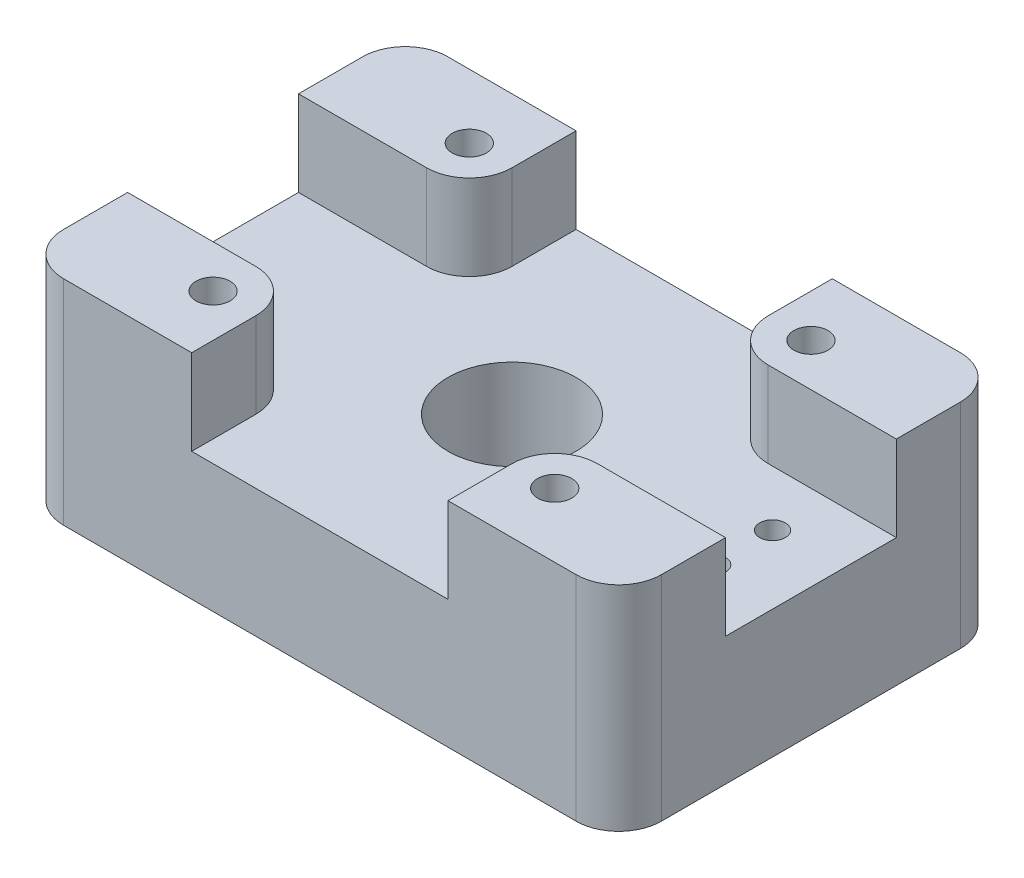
ISO-10303-21;
HEADER;
FILE_DESCRIPTION(('STEP AP214'),'2;1');
FILE_NAME('part.step','',(''),(''),'','','');
FILE_SCHEMA(('AUTOMOTIVE_DESIGN { 1 0 10303 214 1 1 1 1 }'));
ENDSEC;
DATA;
#1=APPLICATION_CONTEXT('core data for automotive mechanical design processes');
#2=APPLICATION_PROTOCOL_DEFINITION('international standard','automotive_design',2000,#1);
#3=PRODUCT_CONTEXT('',#1,'mechanical');
#4=PRODUCT('Part','Part','',(#3));
#5=PRODUCT_RELATED_PRODUCT_CATEGORY('part','',(#4));
#6=PRODUCT_DEFINITION_FORMATION('','',#4);
#7=PRODUCT_DEFINITION_CONTEXT('part definition',#1,'design');
#8=PRODUCT_DEFINITION('design','',#6,#7);
#9=PRODUCT_DEFINITION_SHAPE('','',#8);
#10=(LENGTH_UNIT() NAMED_UNIT(*) SI_UNIT(.MILLI.,.METRE.));
#11=(NAMED_UNIT(*) PLANE_ANGLE_UNIT() SI_UNIT($,.RADIAN.));
#12=(NAMED_UNIT(*) SI_UNIT($,.STERADIAN.) SOLID_ANGLE_UNIT());
#13=UNCERTAINTY_MEASURE_WITH_UNIT(LENGTH_MEASURE(1.E-05),#10,'distance_accuracy_value','');
#14=(GEOMETRIC_REPRESENTATION_CONTEXT(3) GLOBAL_UNCERTAINTY_ASSIGNED_CONTEXT((#13)) GLOBAL_UNIT_ASSIGNED_CONTEXT((#10,
#11,#12)) REPRESENTATION_CONTEXT('',''));
#15=CARTESIAN_POINT('',(0.,0.,0.));
#16=DIRECTION('',(0.,0.,1.));
#17=DIRECTION('',(1.,0.,0.));
#18=AXIS2_PLACEMENT_3D('',#15,#16,#17);
#19=CARTESIAN_POINT('',(-70.,0.,45.));
#20=DIRECTION('',(0.,1.,0.));
#21=DIRECTION('',(0.,0.,1.));
#22=AXIS2_PLACEMENT_3D('',#19,#20,#21);
#23=PLANE('',#22);
#24=CARTESIAN_POINT('',(0.,0.,0.));
#25=DIRECTION('',(0.,1.,0.));
#26=DIRECTION('',(0.,0.,1.));
#27=AXIS2_PLACEMENT_3D('',#24,#25,#26);
#28=CIRCLE('',#27,15.);
#29=CARTESIAN_POINT('',(0.,0.,15.));
#30=VERTEX_POINT('',#29);
#31=EDGE_CURVE('E422',#30,#30,#28,.T.);
#32=ORIENTED_EDGE('',*,*,#31,.T.);
#33=EDGE_LOOP('',(#32));
#34=FACE_BOUND('',#33,.T.);
#35=CARTESIAN_POINT('',(0.,0.,0.));
#36=DIRECTION('',(0.,-1.,0.));
#37=DIRECTION('',(0.,0.,-1.));
#38=AXIS2_PLACEMENT_3D('',#35,#36,#37);
#39=CIRCLE('',#38,22.5);
#40=CARTESIAN_POINT('',(0.,0.,-22.5));
#41=VERTEX_POINT('',#40);
#42=EDGE_CURVE('E248',#41,#41,#39,.T.);
#43=ORIENTED_EDGE('',*,*,#42,.T.);
#44=EDGE_LOOP('',(#43));
#45=FACE_BOUND('',#44,.T.);
#46=ADVANCED_FACE('F33',(#34,#45),#23,.F.);
#47=CARTESIAN_POINT('',(-70.,30.,45.));
#48=DIRECTION('',(0.,1.,0.));
#49=DIRECTION('',(0.,0.,1.));
#50=AXIS2_PLACEMENT_3D('',#47,#48,#49);
#51=PLANE('',#50);
#52=CARTESIAN_POINT('',(54.,30.,7.));
#53=DIRECTION('',(0.,1.,0.));
#54=DIRECTION('',(0.,0.,1.));
#55=AXIS2_PLACEMENT_3D('',#52,#53,#54);
#56=CIRCLE('',#55,3.);
#57=CARTESIAN_POINT('',(54.,30.,10.));
#58=VERTEX_POINT('',#57);
#59=EDGE_CURVE('E662',#58,#58,#56,.T.);
#60=ORIENTED_EDGE('',*,*,#59,.F.);
#61=EDGE_LOOP('',(#60));
#62=FACE_BOUND('',#61,.T.);
#63=CARTESIAN_POINT('',(54.,30.,-7.));
#64=DIRECTION('',(0.,1.,0.));
#65=DIRECTION('',(0.,0.,1.));
#66=AXIS2_PLACEMENT_3D('',#63,#64,#65);
#67=CIRCLE('',#66,3.);
#68=CARTESIAN_POINT('',(54.,30.,-4.));
#69=VERTEX_POINT('',#68);
#70=EDGE_CURVE('E668',#69,#69,#67,.T.);
#71=ORIENTED_EDGE('',*,*,#70,.F.);
#72=EDGE_LOOP('',(#71));
#73=FACE_BOUND('',#72,.T.);
#74=CARTESIAN_POINT('',(0.,30.,0.));
#75=DIRECTION('',(0.,1.,0.));
#76=DIRECTION('',(0.,0.,1.));
#77=AXIS2_PLACEMENT_3D('',#74,#75,#76);
#78=CIRCLE('',#77,15.);
#79=CARTESIAN_POINT('',(0.,30.,15.));
#80=VERTEX_POINT('',#79);
#81=EDGE_CURVE('E406',#80,#80,#78,.T.);
#82=ORIENTED_EDGE('',*,*,#81,.F.);
#83=EDGE_LOOP('',(#82));
#84=FACE_BOUND('',#83,.T.);
#85=DIRECTION('',(0.,0.,-1.));
#86=VECTOR('',#85,1.);
#87=CARTESIAN_POINT('',(70.,30.,-45.));
#88=LINE('',#87,#86);
#89=CARTESIAN_POINT('',(70.,30.,20.));
#90=VERTEX_POINT('',#89);
#91=CARTESIAN_POINT('',(70.,30.,-20.));
#92=VERTEX_POINT('',#91);
#93=EDGE_CURVE('E396',#90,#92,#88,.T.);
#94=ORIENTED_EDGE('',*,*,#93,.T.);
#95=DIRECTION('',(1.,0.,0.));
#96=VECTOR('',#95,1.);
#97=CARTESIAN_POINT('',(40.,30.,-20.));
#98=LINE('',#97,#96);
#99=CARTESIAN_POINT('',(40.,30.,-20.));
#100=VERTEX_POINT('',#99);
#101=EDGE_CURVE('E261',#100,#92,#98,.T.);
#102=ORIENTED_EDGE('',*,*,#101,.F.);
#103=CARTESIAN_POINT('',(40.,30.,-30.));
#104=DIRECTION('',(0.,1.,0.));
#105=DIRECTION('',(0.,0.,1.));
#106=AXIS2_PLACEMENT_3D('',#103,#104,#105);
#107=CIRCLE('',#106,9.99999999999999);
#108=CARTESIAN_POINT('',(30.,30.,-30.));
#109=VERTEX_POINT('',#108);
#110=EDGE_CURVE('E269',#109,#100,#107,.T.);
#111=ORIENTED_EDGE('',*,*,#110,.F.);
#112=DIRECTION('',(0.,0.,1.));
#113=VECTOR('',#112,1.);
#114=CARTESIAN_POINT('',(30.,30.,-45.));
#115=LINE('',#114,#113);
#116=CARTESIAN_POINT('',(30.,30.,-45.));
#117=VERTEX_POINT('',#116);
#118=EDGE_CURVE('E281',#117,#109,#115,.T.);
#119=ORIENTED_EDGE('',*,*,#118,.F.);
#120=DIRECTION('',(-1.,0.,0.));
#121=VECTOR('',#120,1.);
#122=CARTESIAN_POINT('',(-70.,30.,-45.));
#123=LINE('',#122,#121);
#124=CARTESIAN_POINT('',(-30.,30.,-45.));
#125=VERTEX_POINT('',#124);
#126=EDGE_CURVE('E392',#117,#125,#123,.T.);
#127=ORIENTED_EDGE('',*,*,#126,.T.);
#128=DIRECTION('',(0.,0.,-1.));
#129=VECTOR('',#128,1.);
#130=CARTESIAN_POINT('',(-30.,30.,-45.));
#131=LINE('',#130,#129);
#132=CARTESIAN_POINT('',(-30.,30.,-30.));
#133=VERTEX_POINT('',#132);
#134=EDGE_CURVE('E366',#133,#125,#131,.T.);
#135=ORIENTED_EDGE('',*,*,#134,.F.);
#136=CARTESIAN_POINT('',(-40.,30.,-30.));
#137=DIRECTION('',(0.,1.,0.));
#138=DIRECTION('',(0.,0.,-1.));
#139=AXIS2_PLACEMENT_3D('',#136,#137,#138);
#140=CIRCLE('',#139,9.99999999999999);
#141=CARTESIAN_POINT('',(-40.,30.,-20.));
#142=VERTEX_POINT('',#141);
#143=EDGE_CURVE('E375',#142,#133,#140,.T.);
#144=ORIENTED_EDGE('',*,*,#143,.F.);
#145=DIRECTION('',(1.,0.,0.));
#146=VECTOR('',#145,1.);
#147=CARTESIAN_POINT('',(-40.,30.,-20.));
#148=LINE('',#147,#146);
#149=CARTESIAN_POINT('',(-70.,30.,-20.));
#150=VERTEX_POINT('',#149);
#151=EDGE_CURVE('E362',#150,#142,#148,.T.);
#152=ORIENTED_EDGE('',*,*,#151,.F.);
#153=DIRECTION('',(0.,0.,1.));
#154=VECTOR('',#153,1.);
#155=CARTESIAN_POINT('',(-70.,30.,-45.));
#156=LINE('',#155,#154);
#157=CARTESIAN_POINT('',(-70.,30.,19.9999999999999));
#158=VERTEX_POINT('',#157);
#159=EDGE_CURVE('E415',#150,#158,#156,.T.);
#160=ORIENTED_EDGE('',*,*,#159,.T.);
#161=DIRECTION('',(-1.,0.,0.));
#162=VECTOR('',#161,1.);
#163=CARTESIAN_POINT('',(-40.,30.,20.));
#164=LINE('',#163,#162);
#165=CARTESIAN_POINT('',(-40.,30.,20.));
#166=VERTEX_POINT('',#165);
#167=EDGE_CURVE('E330',#166,#158,#164,.T.);
#168=ORIENTED_EDGE('',*,*,#167,.F.);
#169=CARTESIAN_POINT('',(-40.,30.,30.));
#170=DIRECTION('',(0.,1.,0.));
#171=DIRECTION('',(0.,0.,1.));
#172=AXIS2_PLACEMENT_3D('',#169,#170,#171);
#173=CIRCLE('',#172,9.99999999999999);
#174=CARTESIAN_POINT('',(-30.,30.,30.));
#175=VERTEX_POINT('',#174);
#176=EDGE_CURVE('E335',#175,#166,#173,.T.);
#177=ORIENTED_EDGE('',*,*,#176,.F.);
#178=DIRECTION('',(0.,0.,-1.));
#179=VECTOR('',#178,1.);
#180=CARTESIAN_POINT('',(-30.,30.,45.));
#181=LINE('',#180,#179);
#182=CARTESIAN_POINT('',(-30.,30.,45.));
#183=VERTEX_POINT('',#182);
#184=EDGE_CURVE('E346',#183,#175,#181,.T.);
#185=ORIENTED_EDGE('',*,*,#184,.F.);
#186=DIRECTION('',(1.,0.,0.));
#187=VECTOR('',#186,1.);
#188=CARTESIAN_POINT('',(-70.,30.,45.));
#189=LINE('',#188,#187);
#190=CARTESIAN_POINT('',(30.,30.,45.));
#191=VERTEX_POINT('',#190);
#192=EDGE_CURVE('E418',#183,#191,#189,.T.);
#193=ORIENTED_EDGE('',*,*,#192,.T.);
#194=DIRECTION('',(0.,0.,1.));
#195=VECTOR('',#194,1.);
#196=CARTESIAN_POINT('',(30.,30.,45.));
#197=LINE('',#196,#195);
#198=CARTESIAN_POINT('',(30.,30.,30.));
#199=VERTEX_POINT('',#198);
#200=EDGE_CURVE('E302',#199,#191,#197,.T.);
#201=ORIENTED_EDGE('',*,*,#200,.F.);
#202=CARTESIAN_POINT('',(40.,30.,30.));
#203=DIRECTION('',(0.,1.,0.));
#204=DIRECTION('',(0.,0.,-1.));
#205=AXIS2_PLACEMENT_3D('',#202,#203,#204);
#206=CIRCLE('',#205,9.99999999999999);
#207=CARTESIAN_POINT('',(40.,30.,20.));
#208=VERTEX_POINT('',#207);
#209=EDGE_CURVE('E314',#208,#199,#206,.T.);
#210=ORIENTED_EDGE('',*,*,#209,.F.);
#211=DIRECTION('',(-1.,0.,0.));
#212=VECTOR('',#211,1.);
#213=CARTESIAN_POINT('',(40.,30.,20.));
#214=LINE('',#213,#212);
#215=EDGE_CURVE('E297',#90,#208,#214,.T.);
#216=ORIENTED_EDGE('',*,*,#215,.F.);
#217=EDGE_LOOP('',(#94,#102,#111,#119,#127,#135,#144,#152,#160,#168,#177,#185,#193,#201,#210,#216));
#218=FACE_BOUND('',#217,.T.);
#219=ADVANCED_FACE('F427',(#62,#73,#84,#218),#51,.T.);
#220=DIRECTION('',(-1.,0.,0.));
#221=VECTOR('',#220,1.);
#222=CARTESIAN_POINT('',(62.,0.,37.));
#223=LINE('',#222,#221);
#224=CARTESIAN_POINT('',(62.,0.,37.));
#225=VERTEX_POINT('',#224);
#226=CARTESIAN_POINT('',(-62.,0.,37.));
#227=VERTEX_POINT('',#226);
#228=EDGE_CURVE('E254',#225,#227,#223,.T.);
#229=ORIENTED_EDGE('',*,*,#228,.F.);
#230=DIRECTION('',(0.,0.,1.));
#231=VECTOR('',#230,1.);
#232=CARTESIAN_POINT('',(62.,0.,-37.));
#233=LINE('',#232,#231);
#234=CARTESIAN_POINT('',(62.,0.,-37.));
#235=VERTEX_POINT('',#234);
#236=EDGE_CURVE('E225',#235,#225,#233,.T.);
#237=ORIENTED_EDGE('',*,*,#236,.F.);
#238=DIRECTION('',(1.,0.,0.));
#239=VECTOR('',#238,1.);
#240=CARTESIAN_POINT('',(-62.,0.,-37.));
#241=LINE('',#240,#239);
#242=CARTESIAN_POINT('',(-62.,0.,-37.));
#243=VERTEX_POINT('',#242);
#244=EDGE_CURVE('E242',#243,#235,#241,.T.);
#245=ORIENTED_EDGE('',*,*,#244,.F.);
#246=DIRECTION('',(0.,0.,-1.));
#247=VECTOR('',#246,1.);
#248=CARTESIAN_POINT('',(-62.,0.,37.));
#249=LINE('',#248,#247);
#250=EDGE_CURVE('E245',#227,#243,#249,.T.);
#251=ORIENTED_EDGE('',*,*,#250,.F.);
#252=EDGE_LOOP('',(#229,#237,#245,#251));
#253=FACE_BOUND('',#252,.T.);
#254=DIRECTION('',(0.,0.,-1.));
#255=VECTOR('',#254,1.);
#256=CARTESIAN_POINT('',(70.,0.,-45.));
#257=LINE('',#256,#255);
#258=CARTESIAN_POINT('',(70.,0.,35.));
#259=VERTEX_POINT('',#258);
#260=CARTESIAN_POINT('',(70.,0.,-35.));
#261=VERTEX_POINT('',#260);
#262=EDGE_CURVE('E409',#259,#261,#257,.T.);
#263=ORIENTED_EDGE('',*,*,#262,.F.);
#264=CARTESIAN_POINT('',(60.,0.,35.));
#265=DIRECTION('',(0.,1.,0.));
#266=DIRECTION('',(0.,0.,1.));
#267=AXIS2_PLACEMENT_3D('',#264,#265,#266);
#268=CIRCLE('',#267,10.);
#269=CARTESIAN_POINT('',(60.,0.,45.));
#270=VERTEX_POINT('',#269);
#271=EDGE_CURVE('E505',#259,#270,#268,.F.);
#272=ORIENTED_EDGE('',*,*,#271,.T.);
#273=DIRECTION('',(1.,0.,0.));
#274=VECTOR('',#273,1.);
#275=CARTESIAN_POINT('',(-70.,0.,45.));
#276=LINE('',#275,#274);
#277=CARTESIAN_POINT('',(-60.,0.,45.));
#278=VERTEX_POINT('',#277);
#279=EDGE_CURVE('E405',#278,#270,#276,.T.);
#280=ORIENTED_EDGE('',*,*,#279,.F.);
#281=CARTESIAN_POINT('',(-60.,0.,35.));
#282=DIRECTION('',(0.,1.,0.));
#283=DIRECTION('',(0.,0.,1.));
#284=AXIS2_PLACEMENT_3D('',#281,#282,#283);
#285=CIRCLE('',#284,10.);
#286=CARTESIAN_POINT('',(-70.,0.,35.));
#287=VERTEX_POINT('',#286);
#288=EDGE_CURVE('E524',#278,#287,#285,.F.);
#289=ORIENTED_EDGE('',*,*,#288,.T.);
#290=DIRECTION('',(0.,0.,1.));
#291=VECTOR('',#290,1.);
#292=CARTESIAN_POINT('',(-70.,0.,-45.));
#293=LINE('',#292,#291);
#294=CARTESIAN_POINT('',(-70.,0.,-35.));
#295=VERTEX_POINT('',#294);
#296=EDGE_CURVE('E403',#295,#287,#293,.T.);
#297=ORIENTED_EDGE('',*,*,#296,.F.);
#298=CARTESIAN_POINT('',(-60.,0.,-35.));
#299=DIRECTION('',(0.,1.,0.));
#300=DIRECTION('',(0.,0.,1.));
#301=AXIS2_PLACEMENT_3D('',#298,#299,#300);
#302=CIRCLE('',#301,10.);
#303=CARTESIAN_POINT('',(-60.,0.,-45.));
#304=VERTEX_POINT('',#303);
#305=EDGE_CURVE('E517',#295,#304,#302,.F.);
#306=ORIENTED_EDGE('',*,*,#305,.T.);
#307=DIRECTION('',(-1.,0.,0.));
#308=VECTOR('',#307,1.);
#309=CARTESIAN_POINT('',(-70.,0.,-45.));
#310=LINE('',#309,#308);
#311=CARTESIAN_POINT('',(60.,0.,-45.));
#312=VERTEX_POINT('',#311);
#313=EDGE_CURVE('E412',#312,#304,#310,.T.);
#314=ORIENTED_EDGE('',*,*,#313,.F.);
#315=CARTESIAN_POINT('',(60.,0.,-35.));
#316=DIRECTION('',(0.,1.,0.));
#317=DIRECTION('',(0.,0.,1.));
#318=AXIS2_PLACEMENT_3D('',#315,#316,#317);
#319=CIRCLE('',#318,10.);
#320=EDGE_CURVE('E507',#312,#261,#319,.F.);
#321=ORIENTED_EDGE('',*,*,#320,.T.);
#322=EDGE_LOOP('',(#263,#272,#280,#289,#297,#306,#314,#321));
#323=FACE_BOUND('',#322,.T.);
#324=ADVANCED_FACE('F488',(#253,#323),#23,.F.);
#325=CARTESIAN_POINT('',(-70.,30.,-45.));
#326=DIRECTION('',(1.,0.,0.));
#327=DIRECTION('',(0.,0.,-1.));
#328=AXIS2_PLACEMENT_3D('',#325,#326,#327);
#329=PLANE('',#328);
#330=ORIENTED_EDGE('',*,*,#296,.T.);
#331=DIRECTION('',(0.,-1.,0.));
#332=VECTOR('',#331,1.);
#333=CARTESIAN_POINT('',(-70.,30.,35.));
#334=LINE('',#333,#332);
#335=CARTESIAN_POINT('',(-70.,50.,35.));
#336=VERTEX_POINT('',#335);
#337=EDGE_CURVE('E54',#287,#336,#334,.F.);
#338=ORIENTED_EDGE('',*,*,#337,.T.);
#339=DIRECTION('',(0.,0.,1.));
#340=VECTOR('',#339,1.);
#341=CARTESIAN_POINT('',(-70.,50.,20.));
#342=LINE('',#341,#340);
#343=CARTESIAN_POINT('',(-70.,50.,20.));
#344=VERTEX_POINT('',#343);
#345=EDGE_CURVE('E334',#344,#336,#342,.T.);
#346=ORIENTED_EDGE('',*,*,#345,.F.);
#347=DIRECTION('',(0.,-1.,0.));
#348=VECTOR('',#347,1.);
#349=CARTESIAN_POINT('',(-70.,50.,20.));
#350=LINE('',#349,#348);
#351=EDGE_CURVE('E359',#344,#158,#350,.T.);
#352=ORIENTED_EDGE('',*,*,#351,.T.);
#353=ORIENTED_EDGE('',*,*,#159,.F.);
#354=DIRECTION('',(0.,-1.,0.));
#355=VECTOR('',#354,1.);
#356=CARTESIAN_POINT('',(-70.,50.,-20.));
#357=LINE('',#356,#355);
#358=CARTESIAN_POINT('',(-70.,50.,-20.));
#359=VERTEX_POINT('',#358);
#360=EDGE_CURVE('E462',#359,#150,#357,.T.);
#361=ORIENTED_EDGE('',*,*,#360,.F.);
#362=DIRECTION('',(0.,0.,1.));
#363=VECTOR('',#362,1.);
#364=CARTESIAN_POINT('',(-70.,50.,-20.));
#365=LINE('',#364,#363);
#366=CARTESIAN_POINT('',(-70.,50.,-35.));
#367=VERTEX_POINT('',#366);
#368=EDGE_CURVE('E365',#367,#359,#365,.T.);
#369=ORIENTED_EDGE('',*,*,#368,.F.);
#370=DIRECTION('',(0.,-1.,0.));
#371=VECTOR('',#370,1.);
#372=CARTESIAN_POINT('',(-70.,30.,-35.));
#373=LINE('',#372,#371);
#374=EDGE_CURVE('E540',#367,#295,#373,.T.);
#375=ORIENTED_EDGE('',*,*,#374,.T.);
#376=EDGE_LOOP('',(#330,#338,#346,#352,#353,#361,#369,#375));
#377=FACE_BOUND('',#376,.T.);
#378=ADVANCED_FACE('F494',(#377),#329,.F.);
#379=CARTESIAN_POINT('',(-70.,30.,45.));
#380=DIRECTION('',(0.,0.,-1.));
#381=DIRECTION('',(-1.,0.,0.));
#382=AXIS2_PLACEMENT_3D('',#379,#380,#381);
#383=PLANE('',#382);
#384=ORIENTED_EDGE('',*,*,#279,.T.);
#385=DIRECTION('',(0.,-1.,0.));
#386=VECTOR('',#385,1.);
#387=CARTESIAN_POINT('',(60.,30.,45.));
#388=LINE('',#387,#386);
#389=CARTESIAN_POINT('',(60.,50.,45.));
#390=VERTEX_POINT('',#389);
#391=EDGE_CURVE('E531',#270,#390,#388,.F.);
#392=ORIENTED_EDGE('',*,*,#391,.T.);
#393=DIRECTION('',(1.,0.,0.));
#394=VECTOR('',#393,1.);
#395=CARTESIAN_POINT('',(70.,50.,45.));
#396=LINE('',#395,#394);
#397=CARTESIAN_POINT('',(30.,50.,45.));
#398=VERTEX_POINT('',#397);
#399=EDGE_CURVE('E306',#398,#390,#396,.T.);
#400=ORIENTED_EDGE('',*,*,#399,.F.);
#401=DIRECTION('',(0.,-1.,0.));
#402=VECTOR('',#401,1.);
#403=CARTESIAN_POINT('',(30.,50.,45.));
#404=LINE('',#403,#402);
#405=EDGE_CURVE('E321',#398,#191,#404,.T.);
#406=ORIENTED_EDGE('',*,*,#405,.T.);
#407=ORIENTED_EDGE('',*,*,#192,.F.);
#408=DIRECTION('',(0.,-1.,0.));
#409=VECTOR('',#408,1.);
#410=CARTESIAN_POINT('',(-30.,50.,45.));
#411=LINE('',#410,#409);
#412=CARTESIAN_POINT('',(-30.,50.,45.));
#413=VERTEX_POINT('',#412);
#414=EDGE_CURVE('E356',#413,#183,#411,.T.);
#415=ORIENTED_EDGE('',*,*,#414,.F.);
#416=DIRECTION('',(1.,0.,0.));
#417=VECTOR('',#416,1.);
#418=CARTESIAN_POINT('',(-70.,50.,45.));
#419=LINE('',#418,#417);
#420=CARTESIAN_POINT('',(-60.,50.,45.));
#421=VERTEX_POINT('',#420);
#422=EDGE_CURVE('E337',#421,#413,#419,.T.);
#423=ORIENTED_EDGE('',*,*,#422,.F.);
#424=DIRECTION('',(0.,-1.,0.));
#425=VECTOR('',#424,1.);
#426=CARTESIAN_POINT('',(-60.,30.,45.));
#427=LINE('',#426,#425);
#428=EDGE_CURVE('E528',#421,#278,#427,.T.);
#429=ORIENTED_EDGE('',*,*,#428,.T.);
#430=EDGE_LOOP('',(#384,#392,#400,#406,#407,#415,#423,#429));
#431=FACE_BOUND('',#430,.T.);
#432=ADVANCED_FACE('F499',(#431),#383,.F.);
#433=CARTESIAN_POINT('',(70.,30.,-45.));
#434=DIRECTION('',(-1.,0.,0.));
#435=DIRECTION('',(0.,0.,1.));
#436=AXIS2_PLACEMENT_3D('',#433,#434,#435);
#437=PLANE('',#436);
#438=DIRECTION('',(0.,0.,-1.));
#439=VECTOR('',#438,1.);
#440=CARTESIAN_POINT('',(70.,50.,20.));
#441=LINE('',#440,#439);
#442=CARTESIAN_POINT('',(70.,50.,35.));
#443=VERTEX_POINT('',#442);
#444=CARTESIAN_POINT('',(70.,50.,20.));
#445=VERTEX_POINT('',#444);
#446=EDGE_CURVE('E309',#443,#445,#441,.T.);
#447=ORIENTED_EDGE('',*,*,#446,.F.);
#448=DIRECTION('',(0.,-1.,0.));
#449=VECTOR('',#448,1.);
#450=CARTESIAN_POINT('',(70.,30.,35.));
#451=LINE('',#450,#449);
#452=EDGE_CURVE('E511',#443,#259,#451,.T.);
#453=ORIENTED_EDGE('',*,*,#452,.T.);
#454=ORIENTED_EDGE('',*,*,#262,.T.);
#455=DIRECTION('',(0.,-1.,0.));
#456=VECTOR('',#455,1.);
#457=CARTESIAN_POINT('',(70.,30.,-35.));
#458=LINE('',#457,#456);
#459=CARTESIAN_POINT('',(70.,50.,-35.));
#460=VERTEX_POINT('',#459);
#461=EDGE_CURVE('E395',#261,#460,#458,.F.);
#462=ORIENTED_EDGE('',*,*,#461,.T.);
#463=DIRECTION('',(0.,0.,-1.));
#464=VECTOR('',#463,1.);
#465=CARTESIAN_POINT('',(70.,50.,-20.));
#466=LINE('',#465,#464);
#467=CARTESIAN_POINT('',(70.,50.,-20.));
#468=VERTEX_POINT('',#467);
#469=EDGE_CURVE('E268',#468,#460,#466,.T.);
#470=ORIENTED_EDGE('',*,*,#469,.F.);
#471=DIRECTION('',(0.,-1.,0.));
#472=VECTOR('',#471,1.);
#473=CARTESIAN_POINT('',(70.,50.,-20.));
#474=LINE('',#473,#472);
#475=EDGE_CURVE('E294',#468,#92,#474,.T.);
#476=ORIENTED_EDGE('',*,*,#475,.T.);
#477=ORIENTED_EDGE('',*,*,#93,.F.);
#478=DIRECTION('',(0.,-1.,0.));
#479=VECTOR('',#478,1.);
#480=CARTESIAN_POINT('',(70.,50.,20.));
#481=LINE('',#480,#479);
#482=EDGE_CURVE('E311',#445,#90,#481,.T.);
#483=ORIENTED_EDGE('',*,*,#482,.F.);
#484=EDGE_LOOP('',(#447,#453,#454,#462,#470,#476,#477,#483));
#485=FACE_BOUND('',#484,.T.);
#486=ADVANCED_FACE('F432',(#485),#437,.F.);
#487=CARTESIAN_POINT('',(-70.,30.,-45.));
#488=DIRECTION('',(0.,0.,1.));
#489=DIRECTION('',(1.,0.,0.));
#490=AXIS2_PLACEMENT_3D('',#487,#488,#489);
#491=PLANE('',#490);
#492=DIRECTION('',(-1.,0.,0.));
#493=VECTOR('',#492,1.);
#494=CARTESIAN_POINT('',(70.,50.,-45.));
#495=LINE('',#494,#493);
#496=CARTESIAN_POINT('',(60.,50.,-45.));
#497=VERTEX_POINT('',#496);
#498=CARTESIAN_POINT('',(30.,50.,-45.));
#499=VERTEX_POINT('',#498);
#500=EDGE_CURVE('E272',#497,#499,#495,.T.);
#501=ORIENTED_EDGE('',*,*,#500,.F.);
#502=DIRECTION('',(0.,-1.,0.));
#503=VECTOR('',#502,1.);
#504=CARTESIAN_POINT('',(60.,30.,-45.));
#505=LINE('',#504,#503);
#506=EDGE_CURVE('E537',#497,#312,#505,.T.);
#507=ORIENTED_EDGE('',*,*,#506,.T.);
#508=ORIENTED_EDGE('',*,*,#313,.T.);
#509=DIRECTION('',(0.,-1.,0.));
#510=VECTOR('',#509,1.);
#511=CARTESIAN_POINT('',(-60.,30.,-45.));
#512=LINE('',#511,#510);
#513=CARTESIAN_POINT('',(-60.,50.,-45.));
#514=VERTEX_POINT('',#513);
#515=EDGE_CURVE('E535',#304,#514,#512,.F.);
#516=ORIENTED_EDGE('',*,*,#515,.T.);
#517=DIRECTION('',(-1.,0.,0.));
#518=VECTOR('',#517,1.);
#519=CARTESIAN_POINT('',(-70.,50.,-45.));
#520=LINE('',#519,#518);
#521=CARTESIAN_POINT('',(-30.,50.,-45.));
#522=VERTEX_POINT('',#521);
#523=EDGE_CURVE('E363',#522,#514,#520,.T.);
#524=ORIENTED_EDGE('',*,*,#523,.F.);
#525=DIRECTION('',(0.,-1.,0.));
#526=VECTOR('',#525,1.);
#527=CARTESIAN_POINT('',(-30.,50.,-45.));
#528=LINE('',#527,#526);
#529=EDGE_CURVE('E374',#522,#125,#528,.T.);
#530=ORIENTED_EDGE('',*,*,#529,.T.);
#531=ORIENTED_EDGE('',*,*,#126,.F.);
#532=DIRECTION('',(0.,-1.,0.));
#533=VECTOR('',#532,1.);
#534=CARTESIAN_POINT('',(30.,50.,-45.));
#535=LINE('',#534,#533);
#536=EDGE_CURVE('E291',#499,#117,#535,.T.);
#537=ORIENTED_EDGE('',*,*,#536,.F.);
#538=EDGE_LOOP('',(#501,#507,#508,#516,#524,#530,#531,#537));
#539=FACE_BOUND('',#538,.T.);
#540=ADVANCED_FACE('F448',(#539),#491,.F.);
#541=CARTESIAN_POINT('',(0.,30.,0.));
#542=DIRECTION('',(0.,-1.,0.));
#543=DIRECTION('',(0.,0.,-1.));
#544=AXIS2_PLACEMENT_3D('',#541,#542,#543);
#545=CYLINDRICAL_SURFACE('',#544,15.);
#546=ORIENTED_EDGE('',*,*,#81,.T.);
#547=EDGE_LOOP('',(#546));
#548=FACE_BOUND('',#547,.T.);
#549=ORIENTED_EDGE('',*,*,#31,.F.);
#550=EDGE_LOOP('',(#549));
#551=FACE_BOUND('',#550,.T.);
#552=ADVANCED_FACE('F473',(#548,#551),#545,.F.);
#553=CARTESIAN_POINT('',(-40.,50.,-20.));
#554=DIRECTION('',(0.,0.,-1.));
#555=DIRECTION('',(-1.,0.,0.));
#556=AXIS2_PLACEMENT_3D('',#553,#554,#555);
#557=PLANE('',#556);
#558=ORIENTED_EDGE('',*,*,#151,.T.);
#559=DIRECTION('',(0.,-1.,0.));
#560=VECTOR('',#559,1.);
#561=CARTESIAN_POINT('',(-40.,50.,-20.));
#562=LINE('',#561,#560);
#563=CARTESIAN_POINT('',(-40.,50.,-20.));
#564=VERTEX_POINT('',#563);
#565=EDGE_CURVE('E460',#564,#142,#562,.T.);
#566=ORIENTED_EDGE('',*,*,#565,.F.);
#567=DIRECTION('',(1.,0.,0.));
#568=VECTOR('',#567,1.);
#569=CARTESIAN_POINT('',(-40.,50.,-20.));
#570=LINE('',#569,#568);
#571=EDGE_CURVE('E368',#359,#564,#570,.T.);
#572=ORIENTED_EDGE('',*,*,#571,.F.);
#573=ORIENTED_EDGE('',*,*,#360,.T.);
#574=EDGE_LOOP('',(#558,#566,#572,#573));
#575=FACE_BOUND('',#574,.T.);
#576=ADVANCED_FACE('F475',(#575),#557,.F.);
#577=CARTESIAN_POINT('',(-40.,50.,-30.));
#578=DIRECTION('',(0.,-1.,0.));
#579=DIRECTION('',(0.,0.,-1.));
#580=AXIS2_PLACEMENT_3D('',#577,#578,#579);
#581=CYLINDRICAL_SURFACE('',#580,9.99999999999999);
#582=ORIENTED_EDGE('',*,*,#143,.T.);
#583=DIRECTION('',(0.,-1.,0.));
#584=VECTOR('',#583,1.);
#585=CARTESIAN_POINT('',(-30.,50.,-30.));
#586=LINE('',#585,#584);
#587=CARTESIAN_POINT('',(-30.,50.,-30.));
#588=VERTEX_POINT('',#587);
#589=EDGE_CURVE('E380',#588,#133,#586,.T.);
#590=ORIENTED_EDGE('',*,*,#589,.F.);
#591=CARTESIAN_POINT('',(-40.,50.,-30.));
#592=DIRECTION('',(0.,1.,0.));
#593=DIRECTION('',(0.,0.,-1.));
#594=AXIS2_PLACEMENT_3D('',#591,#592,#593);
#595=CIRCLE('',#594,9.99999999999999);
#596=EDGE_CURVE('E370',#564,#588,#595,.T.);
#597=ORIENTED_EDGE('',*,*,#596,.F.);
#598=ORIENTED_EDGE('',*,*,#565,.T.);
#599=EDGE_LOOP('',(#582,#590,#597,#598));
#600=FACE_BOUND('',#599,.T.);
#601=ADVANCED_FACE('F481',(#600),#581,.T.);
#602=CARTESIAN_POINT('',(-30.,50.,-45.));
#603=DIRECTION('',(-1.,0.,0.));
#604=DIRECTION('',(0.,0.,1.));
#605=AXIS2_PLACEMENT_3D('',#602,#603,#604);
#606=PLANE('',#605);
#607=ORIENTED_EDGE('',*,*,#134,.T.);
#608=ORIENTED_EDGE('',*,*,#529,.F.);
#609=DIRECTION('',(0.,0.,-1.));
#610=VECTOR('',#609,1.);
#611=CARTESIAN_POINT('',(-30.,50.,-45.));
#612=LINE('',#611,#610);
#613=EDGE_CURVE('E372',#588,#522,#612,.T.);
#614=ORIENTED_EDGE('',*,*,#613,.F.);
#615=ORIENTED_EDGE('',*,*,#589,.T.);
#616=EDGE_LOOP('',(#607,#608,#614,#615));
#617=FACE_BOUND('',#616,.T.);
#618=ADVANCED_FACE('F455',(#617),#606,.F.);
#619=CARTESIAN_POINT('',(-40.,50.,-30.));
#620=DIRECTION('',(0.,-1.,0.));
#621=DIRECTION('',(0.,0.,-1.));
#622=AXIS2_PLACEMENT_3D('',#619,#620,#621);
#623=PLANE('',#622);
#624=CARTESIAN_POINT('',(-40.,50.,-30.));
#625=DIRECTION('',(0.,1.,0.));
#626=DIRECTION('',(0.,0.,1.));
#627=AXIS2_PLACEMENT_3D('',#624,#625,#626);
#628=CIRCLE('',#627,4.00000000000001);
#629=CARTESIAN_POINT('',(-40.,50.,-26.));
#630=VERTEX_POINT('',#629);
#631=EDGE_CURVE('E684',#630,#630,#628,.T.);
#632=ORIENTED_EDGE('',*,*,#631,.F.);
#633=EDGE_LOOP('',(#632));
#634=FACE_BOUND('',#633,.T.);
#635=ORIENTED_EDGE('',*,*,#523,.T.);
#636=CARTESIAN_POINT('',(-60.,50.,-35.));
#637=DIRECTION('',(0.,-1.,0.));
#638=DIRECTION('',(0.,0.,-1.));
#639=AXIS2_PLACEMENT_3D('',#636,#637,#638);
#640=CIRCLE('',#639,10.);
#641=EDGE_CURVE('E11',#514,#367,#640,.F.);
#642=ORIENTED_EDGE('',*,*,#641,.T.);
#643=ORIENTED_EDGE('',*,*,#368,.T.);
#644=ORIENTED_EDGE('',*,*,#571,.T.);
#645=ORIENTED_EDGE('',*,*,#596,.T.);
#646=ORIENTED_EDGE('',*,*,#613,.T.);
#647=EDGE_LOOP('',(#635,#642,#643,#644,#645,#646));
#648=FACE_BOUND('',#647,.T.);
#649=ADVANCED_FACE('F558',(#634,#648),#623,.F.);
#650=CARTESIAN_POINT('',(-40.,50.,20.));
#651=DIRECTION('',(0.,0.,1.));
#652=DIRECTION('',(1.,0.,0.));
#653=AXIS2_PLACEMENT_3D('',#650,#651,#652);
#654=PLANE('',#653);
#655=ORIENTED_EDGE('',*,*,#167,.T.);
#656=ORIENTED_EDGE('',*,*,#351,.F.);
#657=DIRECTION('',(-1.,0.,0.));
#658=VECTOR('',#657,1.);
#659=CARTESIAN_POINT('',(-40.,50.,20.));
#660=LINE('',#659,#658);
#661=CARTESIAN_POINT('',(-40.,50.,20.));
#662=VERTEX_POINT('',#661);
#663=EDGE_CURVE('E331',#662,#344,#660,.T.);
#664=ORIENTED_EDGE('',*,*,#663,.F.);
#665=DIRECTION('',(0.,-1.,0.));
#666=VECTOR('',#665,1.);
#667=CARTESIAN_POINT('',(-40.,50.,20.));
#668=LINE('',#667,#666);
#669=EDGE_CURVE('E343',#662,#166,#668,.T.);
#670=ORIENTED_EDGE('',*,*,#669,.T.);
#671=EDGE_LOOP('',(#655,#656,#664,#670));
#672=FACE_BOUND('',#671,.T.);
#673=ADVANCED_FACE('F569',(#672),#654,.F.);
#674=CARTESIAN_POINT('',(-30.,50.,45.));
#675=DIRECTION('',(-1.,0.,0.));
#676=DIRECTION('',(0.,0.,1.));
#677=AXIS2_PLACEMENT_3D('',#674,#675,#676);
#678=PLANE('',#677);
#679=ORIENTED_EDGE('',*,*,#184,.T.);
#680=DIRECTION('',(0.,-1.,0.));
#681=VECTOR('',#680,1.);
#682=CARTESIAN_POINT('',(-30.,50.,30.));
#683=LINE('',#682,#681);
#684=CARTESIAN_POINT('',(-30.,50.,30.));
#685=VERTEX_POINT('',#684);
#686=EDGE_CURVE('E353',#685,#175,#683,.T.);
#687=ORIENTED_EDGE('',*,*,#686,.F.);
#688=DIRECTION('',(0.,0.,-1.));
#689=VECTOR('',#688,1.);
#690=CARTESIAN_POINT('',(-30.,50.,45.));
#691=LINE('',#690,#689);
#692=EDGE_CURVE('E339',#413,#685,#691,.T.);
#693=ORIENTED_EDGE('',*,*,#692,.F.);
#694=ORIENTED_EDGE('',*,*,#414,.T.);
#695=EDGE_LOOP('',(#679,#687,#693,#694));
#696=FACE_BOUND('',#695,.T.);
#697=ADVANCED_FACE('F573',(#696),#678,.F.);
#698=CARTESIAN_POINT('',(-40.,50.,30.));
#699=DIRECTION('',(0.,-1.,0.));
#700=DIRECTION('',(0.,0.,-1.));
#701=AXIS2_PLACEMENT_3D('',#698,#699,#700);
#702=CYLINDRICAL_SURFACE('',#701,9.99999999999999);
#703=ORIENTED_EDGE('',*,*,#176,.T.);
#704=ORIENTED_EDGE('',*,*,#669,.F.);
#705=CARTESIAN_POINT('',(-40.,50.,30.));
#706=DIRECTION('',(0.,1.,0.));
#707=DIRECTION('',(0.,0.,1.));
#708=AXIS2_PLACEMENT_3D('',#705,#706,#707);
#709=CIRCLE('',#708,9.99999999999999);
#710=EDGE_CURVE('E341',#685,#662,#709,.T.);
#711=ORIENTED_EDGE('',*,*,#710,.F.);
#712=ORIENTED_EDGE('',*,*,#686,.T.);
#713=EDGE_LOOP('',(#703,#704,#711,#712));
#714=FACE_BOUND('',#713,.T.);
#715=ADVANCED_FACE('F577',(#714),#702,.T.);
#716=CARTESIAN_POINT('',(-40.,50.,30.));
#717=DIRECTION('',(0.,1.,0.));
#718=DIRECTION('',(0.,0.,1.));
#719=AXIS2_PLACEMENT_3D('',#716,#717,#718);
#720=PLANE('',#719);
#721=CARTESIAN_POINT('',(-40.,50.,30.));
#722=DIRECTION('',(0.,1.,0.));
#723=DIRECTION('',(0.,0.,1.));
#724=AXIS2_PLACEMENT_3D('',#721,#722,#723);
#725=CIRCLE('',#724,4.00000000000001);
#726=CARTESIAN_POINT('',(-40.,50.,34.));
#727=VERTEX_POINT('',#726);
#728=EDGE_CURVE('E680',#727,#727,#725,.T.);
#729=ORIENTED_EDGE('',*,*,#728,.F.);
#730=EDGE_LOOP('',(#729));
#731=FACE_BOUND('',#730,.T.);
#732=ORIENTED_EDGE('',*,*,#345,.T.);
#733=CARTESIAN_POINT('',(-60.,50.,35.));
#734=DIRECTION('',(0.,1.,0.));
#735=DIRECTION('',(0.,0.,1.));
#736=AXIS2_PLACEMENT_3D('',#733,#734,#735);
#737=CIRCLE('',#736,10.);
#738=EDGE_CURVE('E41',#336,#421,#737,.T.);
#739=ORIENTED_EDGE('',*,*,#738,.T.);
#740=ORIENTED_EDGE('',*,*,#422,.T.);
#741=ORIENTED_EDGE('',*,*,#692,.T.);
#742=ORIENTED_EDGE('',*,*,#710,.T.);
#743=ORIENTED_EDGE('',*,*,#663,.T.);
#744=EDGE_LOOP('',(#732,#739,#740,#741,#742,#743));
#745=FACE_BOUND('',#744,.T.);
#746=ADVANCED_FACE('F546',(#731,#745),#720,.T.);
#747=CARTESIAN_POINT('',(40.,50.,20.));
#748=DIRECTION('',(0.,0.,1.));
#749=DIRECTION('',(1.,0.,0.));
#750=AXIS2_PLACEMENT_3D('',#747,#748,#749);
#751=PLANE('',#750);
#752=ORIENTED_EDGE('',*,*,#215,.T.);
#753=DIRECTION('',(0.,-1.,0.));
#754=VECTOR('',#753,1.);
#755=CARTESIAN_POINT('',(40.,50.,20.));
#756=LINE('',#755,#754);
#757=CARTESIAN_POINT('',(40.,50.,20.));
#758=VERTEX_POINT('',#757);
#759=EDGE_CURVE('E327',#758,#208,#756,.T.);
#760=ORIENTED_EDGE('',*,*,#759,.F.);
#761=DIRECTION('',(-1.,0.,0.));
#762=VECTOR('',#761,1.);
#763=CARTESIAN_POINT('',(40.,50.,20.));
#764=LINE('',#763,#762);
#765=EDGE_CURVE('E298',#445,#758,#764,.T.);
#766=ORIENTED_EDGE('',*,*,#765,.F.);
#767=ORIENTED_EDGE('',*,*,#482,.T.);
#768=EDGE_LOOP('',(#752,#760,#766,#767));
#769=FACE_BOUND('',#768,.T.);
#770=ADVANCED_FACE('F584',(#769),#751,.F.);
#771=CARTESIAN_POINT('',(40.,50.,30.));
#772=DIRECTION('',(0.,-1.,0.));
#773=DIRECTION('',(0.,0.,-1.));
#774=AXIS2_PLACEMENT_3D('',#771,#772,#773);
#775=CYLINDRICAL_SURFACE('',#774,9.99999999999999);
#776=ORIENTED_EDGE('',*,*,#209,.T.);
#777=DIRECTION('',(0.,-1.,0.));
#778=VECTOR('',#777,1.);
#779=CARTESIAN_POINT('',(30.,50.,30.));
#780=LINE('',#779,#778);
#781=CARTESIAN_POINT('',(30.,50.,30.));
#782=VERTEX_POINT('',#781);
#783=EDGE_CURVE('E324',#782,#199,#780,.T.);
#784=ORIENTED_EDGE('',*,*,#783,.F.);
#785=CARTESIAN_POINT('',(40.,50.,30.));
#786=DIRECTION('',(0.,1.,0.));
#787=DIRECTION('',(0.,0.,-1.));
#788=AXIS2_PLACEMENT_3D('',#785,#786,#787);
#789=CIRCLE('',#788,9.99999999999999);
#790=EDGE_CURVE('E301',#758,#782,#789,.T.);
#791=ORIENTED_EDGE('',*,*,#790,.F.);
#792=ORIENTED_EDGE('',*,*,#759,.T.);
#793=EDGE_LOOP('',(#776,#784,#791,#792));
#794=FACE_BOUND('',#793,.T.);
#795=ADVANCED_FACE('F588',(#794),#775,.T.);
#796=CARTESIAN_POINT('',(30.,50.,45.));
#797=DIRECTION('',(1.,0.,0.));
#798=DIRECTION('',(0.,0.,-1.));
#799=AXIS2_PLACEMENT_3D('',#796,#797,#798);
#800=PLANE('',#799);
#801=ORIENTED_EDGE('',*,*,#200,.T.);
#802=ORIENTED_EDGE('',*,*,#405,.F.);
#803=DIRECTION('',(0.,0.,1.));
#804=VECTOR('',#803,1.);
#805=CARTESIAN_POINT('',(30.,50.,45.));
#806=LINE('',#805,#804);
#807=EDGE_CURVE('E304',#782,#398,#806,.T.);
#808=ORIENTED_EDGE('',*,*,#807,.F.);
#809=ORIENTED_EDGE('',*,*,#783,.T.);
#810=EDGE_LOOP('',(#801,#802,#808,#809));
#811=FACE_BOUND('',#810,.T.);
#812=ADVANCED_FACE('F592',(#811),#800,.F.);
#813=CARTESIAN_POINT('',(40.,50.,30.));
#814=DIRECTION('',(0.,-1.,0.));
#815=DIRECTION('',(0.,0.,-1.));
#816=AXIS2_PLACEMENT_3D('',#813,#814,#815);
#817=PLANE('',#816);
#818=CARTESIAN_POINT('',(40.,50.,30.));
#819=DIRECTION('',(0.,1.,0.));
#820=DIRECTION('',(0.,0.,1.));
#821=AXIS2_PLACEMENT_3D('',#818,#819,#820);
#822=CIRCLE('',#821,4.00000000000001);
#823=CARTESIAN_POINT('',(40.,50.,34.));
#824=VERTEX_POINT('',#823);
#825=EDGE_CURVE('E676',#824,#824,#822,.T.);
#826=ORIENTED_EDGE('',*,*,#825,.F.);
#827=EDGE_LOOP('',(#826));
#828=FACE_BOUND('',#827,.T.);
#829=ORIENTED_EDGE('',*,*,#399,.T.);
#830=CARTESIAN_POINT('',(60.,50.,35.));
#831=DIRECTION('',(0.,-1.,0.));
#832=DIRECTION('',(0.,0.,-1.));
#833=AXIS2_PLACEMENT_3D('',#830,#831,#832);
#834=CIRCLE('',#833,10.);
#835=EDGE_CURVE('E533',#390,#443,#834,.F.);
#836=ORIENTED_EDGE('',*,*,#835,.T.);
#837=ORIENTED_EDGE('',*,*,#446,.T.);
#838=ORIENTED_EDGE('',*,*,#765,.T.);
#839=ORIENTED_EDGE('',*,*,#790,.T.);
#840=ORIENTED_EDGE('',*,*,#807,.T.);
#841=EDGE_LOOP('',(#829,#836,#837,#838,#839,#840));
#842=FACE_BOUND('',#841,.T.);
#843=ADVANCED_FACE('F596',(#828,#842),#817,.F.);
#844=CARTESIAN_POINT('',(40.,50.,-20.));
#845=DIRECTION('',(0.,0.,-1.));
#846=DIRECTION('',(-1.,0.,0.));
#847=AXIS2_PLACEMENT_3D('',#844,#845,#846);
#848=PLANE('',#847);
#849=ORIENTED_EDGE('',*,*,#101,.T.);
#850=ORIENTED_EDGE('',*,*,#475,.F.);
#851=DIRECTION('',(1.,0.,0.));
#852=VECTOR('',#851,1.);
#853=CARTESIAN_POINT('',(40.,50.,-20.));
#854=LINE('',#853,#852);
#855=CARTESIAN_POINT('',(40.,50.,-20.));
#856=VERTEX_POINT('',#855);
#857=EDGE_CURVE('E265',#856,#468,#854,.T.);
#858=ORIENTED_EDGE('',*,*,#857,.F.);
#859=DIRECTION('',(0.,-1.,0.));
#860=VECTOR('',#859,1.);
#861=CARTESIAN_POINT('',(40.,50.,-20.));
#862=LINE('',#861,#860);
#863=EDGE_CURVE('E278',#856,#100,#862,.T.);
#864=ORIENTED_EDGE('',*,*,#863,.T.);
#865=EDGE_LOOP('',(#849,#850,#858,#864));
#866=FACE_BOUND('',#865,.T.);
#867=ADVANCED_FACE('F435',(#866),#848,.F.);
#868=CARTESIAN_POINT('',(30.,50.,-45.));
#869=DIRECTION('',(1.,0.,0.));
#870=DIRECTION('',(0.,0.,-1.));
#871=AXIS2_PLACEMENT_3D('',#868,#869,#870);
#872=PLANE('',#871);
#873=ORIENTED_EDGE('',*,*,#118,.T.);
#874=DIRECTION('',(0.,-1.,0.));
#875=VECTOR('',#874,1.);
#876=CARTESIAN_POINT('',(30.,50.,-30.));
#877=LINE('',#876,#875);
#878=CARTESIAN_POINT('',(30.,50.,-30.));
#879=VERTEX_POINT('',#878);
#880=EDGE_CURVE('E288',#879,#109,#877,.T.);
#881=ORIENTED_EDGE('',*,*,#880,.F.);
#882=DIRECTION('',(0.,0.,1.));
#883=VECTOR('',#882,1.);
#884=CARTESIAN_POINT('',(30.,50.,-45.));
#885=LINE('',#884,#883);
#886=EDGE_CURVE('E274',#499,#879,#885,.T.);
#887=ORIENTED_EDGE('',*,*,#886,.F.);
#888=ORIENTED_EDGE('',*,*,#536,.T.);
#889=EDGE_LOOP('',(#873,#881,#887,#888));
#890=FACE_BOUND('',#889,.T.);
#891=ADVANCED_FACE('F443',(#890),#872,.F.);
#892=CARTESIAN_POINT('',(40.,50.,-30.));
#893=DIRECTION('',(0.,-1.,0.));
#894=DIRECTION('',(0.,0.,-1.));
#895=AXIS2_PLACEMENT_3D('',#892,#893,#894);
#896=CYLINDRICAL_SURFACE('',#895,9.99999999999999);
#897=ORIENTED_EDGE('',*,*,#110,.T.);
#898=ORIENTED_EDGE('',*,*,#863,.F.);
#899=CARTESIAN_POINT('',(40.,50.,-30.));
#900=DIRECTION('',(0.,1.,0.));
#901=DIRECTION('',(0.,0.,1.));
#902=AXIS2_PLACEMENT_3D('',#899,#900,#901);
#903=CIRCLE('',#902,9.99999999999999);
#904=EDGE_CURVE('E276',#879,#856,#903,.T.);
#905=ORIENTED_EDGE('',*,*,#904,.F.);
#906=ORIENTED_EDGE('',*,*,#880,.T.);
#907=EDGE_LOOP('',(#897,#898,#905,#906));
#908=FACE_BOUND('',#907,.T.);
#909=ADVANCED_FACE('F439',(#908),#896,.T.);
#910=CARTESIAN_POINT('',(40.,50.,-30.));
#911=DIRECTION('',(0.,1.,0.));
#912=DIRECTION('',(0.,0.,1.));
#913=AXIS2_PLACEMENT_3D('',#910,#911,#912);
#914=PLANE('',#913);
#915=CARTESIAN_POINT('',(40.,50.,-30.));
#916=DIRECTION('',(0.,1.,0.));
#917=DIRECTION('',(0.,0.,1.));
#918=AXIS2_PLACEMENT_3D('',#915,#916,#917);
#919=CIRCLE('',#918,4.00000000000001);
#920=CARTESIAN_POINT('',(40.,50.,-26.));
#921=VERTEX_POINT('',#920);
#922=EDGE_CURVE('E672',#921,#921,#919,.T.);
#923=ORIENTED_EDGE('',*,*,#922,.F.);
#924=EDGE_LOOP('',(#923));
#925=FACE_BOUND('',#924,.T.);
#926=ORIENTED_EDGE('',*,*,#469,.T.);
#927=CARTESIAN_POINT('',(60.,50.,-35.));
#928=DIRECTION('',(0.,1.,0.));
#929=DIRECTION('',(0.,0.,1.));
#930=AXIS2_PLACEMENT_3D('',#927,#928,#929);
#931=CIRCLE('',#930,10.);
#932=EDGE_CURVE('E515',#460,#497,#931,.T.);
#933=ORIENTED_EDGE('',*,*,#932,.T.);
#934=ORIENTED_EDGE('',*,*,#500,.T.);
#935=ORIENTED_EDGE('',*,*,#886,.T.);
#936=ORIENTED_EDGE('',*,*,#904,.T.);
#937=ORIENTED_EDGE('',*,*,#857,.T.);
#938=EDGE_LOOP('',(#926,#933,#934,#935,#936,#937));
#939=FACE_BOUND('',#938,.T.);
#940=ADVANCED_FACE('F607',(#925,#939),#914,.T.);
#941=CARTESIAN_POINT('',(62.,10.,-37.));
#942=DIRECTION('',(1.,0.,0.));
#943=DIRECTION('',(0.,0.,-1.));
#944=AXIS2_PLACEMENT_3D('',#941,#942,#943);
#945=PLANE('',#944);
#946=ORIENTED_EDGE('',*,*,#236,.T.);
#947=DIRECTION('',(0.,-1.,0.));
#948=VECTOR('',#947,1.);
#949=CARTESIAN_POINT('',(62.,10.,37.));
#950=LINE('',#949,#948);
#951=CARTESIAN_POINT('',(62.,10.,37.));
#952=VERTEX_POINT('',#951);
#953=EDGE_CURVE('E218',#952,#225,#950,.T.);
#954=ORIENTED_EDGE('',*,*,#953,.F.);
#955=DIRECTION('',(0.,0.,1.));
#956=VECTOR('',#955,1.);
#957=CARTESIAN_POINT('',(62.,10.,-37.));
#958=LINE('',#957,#956);
#959=CARTESIAN_POINT('',(62.,10.,-37.));
#960=VERTEX_POINT('',#959);
#961=EDGE_CURVE('E222',#960,#952,#958,.T.);
#962=ORIENTED_EDGE('',*,*,#961,.F.);
#963=DIRECTION('',(0.,-1.,0.));
#964=VECTOR('',#963,1.);
#965=CARTESIAN_POINT('',(62.,10.,-37.));
#966=LINE('',#965,#964);
#967=EDGE_CURVE('E259',#960,#235,#966,.T.);
#968=ORIENTED_EDGE('',*,*,#967,.T.);
#969=EDGE_LOOP('',(#946,#954,#962,#968));
#970=FACE_BOUND('',#969,.T.);
#971=ADVANCED_FACE('F220',(#970),#945,.F.);
#972=CARTESIAN_POINT('',(-62.,10.,-37.));
#973=DIRECTION('',(0.,0.,-1.));
#974=DIRECTION('',(-1.,0.,0.));
#975=AXIS2_PLACEMENT_3D('',#972,#973,#974);
#976=PLANE('',#975);
#977=ORIENTED_EDGE('',*,*,#244,.T.);
#978=ORIENTED_EDGE('',*,*,#967,.F.);
#979=DIRECTION('',(1.,0.,0.));
#980=VECTOR('',#979,1.);
#981=CARTESIAN_POINT('',(-62.,10.,-37.));
#982=LINE('',#981,#980);
#983=CARTESIAN_POINT('',(-62.,10.,-37.));
#984=VERTEX_POINT('',#983);
#985=EDGE_CURVE('E230',#984,#960,#982,.T.);
#986=ORIENTED_EDGE('',*,*,#985,.F.);
#987=DIRECTION('',(0.,-1.,0.));
#988=VECTOR('',#987,1.);
#989=CARTESIAN_POINT('',(-62.,10.,-37.));
#990=LINE('',#989,#988);
#991=EDGE_CURVE('E262',#984,#243,#990,.T.);
#992=ORIENTED_EDGE('',*,*,#991,.T.);
#993=EDGE_LOOP('',(#977,#978,#986,#992));
#994=FACE_BOUND('',#993,.T.);
#995=ADVANCED_FACE('F613',(#994),#976,.F.);
#996=CARTESIAN_POINT('',(-62.,10.,37.));
#997=DIRECTION('',(-1.,0.,0.));
#998=DIRECTION('',(0.,0.,1.));
#999=AXIS2_PLACEMENT_3D('',#996,#997,#998);
#1000=PLANE('',#999);
#1001=ORIENTED_EDGE('',*,*,#250,.T.);
#1002=ORIENTED_EDGE('',*,*,#991,.F.);
#1003=DIRECTION('',(0.,0.,-1.));
#1004=VECTOR('',#1003,1.);
#1005=CARTESIAN_POINT('',(-62.,10.,37.));
#1006=LINE('',#1005,#1004);
#1007=CARTESIAN_POINT('',(-62.,10.,37.));
#1008=VERTEX_POINT('',#1007);
#1009=EDGE_CURVE('E238',#1008,#984,#1006,.T.);
#1010=ORIENTED_EDGE('',*,*,#1009,.F.);
#1011=DIRECTION('',(0.,-1.,0.));
#1012=VECTOR('',#1011,1.);
#1013=CARTESIAN_POINT('',(-62.,10.,37.));
#1014=LINE('',#1013,#1012);
#1015=EDGE_CURVE('E229',#1008,#227,#1014,.T.);
#1016=ORIENTED_EDGE('',*,*,#1015,.T.);
#1017=EDGE_LOOP('',(#1001,#1002,#1010,#1016));
#1018=FACE_BOUND('',#1017,.T.);
#1019=ADVANCED_FACE('F616',(#1018),#1000,.F.);
#1020=CARTESIAN_POINT('',(62.,10.,37.));
#1021=DIRECTION('',(0.,0.,1.));
#1022=DIRECTION('',(1.,0.,0.));
#1023=AXIS2_PLACEMENT_3D('',#1020,#1021,#1022);
#1024=PLANE('',#1023);
#1025=ORIENTED_EDGE('',*,*,#228,.T.);
#1026=ORIENTED_EDGE('',*,*,#1015,.F.);
#1027=DIRECTION('',(-1.,0.,0.));
#1028=VECTOR('',#1027,1.);
#1029=CARTESIAN_POINT('',(62.,10.,37.));
#1030=LINE('',#1029,#1028);
#1031=EDGE_CURVE('E233',#952,#1008,#1030,.T.);
#1032=ORIENTED_EDGE('',*,*,#1031,.F.);
#1033=ORIENTED_EDGE('',*,*,#953,.T.);
#1034=EDGE_LOOP('',(#1025,#1026,#1032,#1033));
#1035=FACE_BOUND('',#1034,.T.);
#1036=ADVANCED_FACE('F234',(#1035),#1024,.F.);
#1037=CARTESIAN_POINT('',(62.,10.,37.));
#1038=DIRECTION('',(0.,-1.,0.));
#1039=DIRECTION('',(0.,0.,-1.));
#1040=AXIS2_PLACEMENT_3D('',#1037,#1038,#1039);
#1041=PLANE('',#1040);
#1042=CARTESIAN_POINT('',(54.,10.,7.));
#1043=DIRECTION('',(0.,-1.,0.));
#1044=DIRECTION('',(0.,0.,-1.));
#1045=AXIS2_PLACEMENT_3D('',#1042,#1043,#1044);
#1046=CIRCLE('',#1045,3.);
#1047=CARTESIAN_POINT('',(54.,10.,4.));
#1048=VERTEX_POINT('',#1047);
#1049=EDGE_CURVE('E520',#1048,#1048,#1046,.T.);
#1050=ORIENTED_EDGE('',*,*,#1049,.F.);
#1051=EDGE_LOOP('',(#1050));
#1052=FACE_BOUND('',#1051,.T.);
#1053=CARTESIAN_POINT('',(54.,10.,-7.));
#1054=DIRECTION('',(0.,-1.,0.));
#1055=DIRECTION('',(0.,0.,-1.));
#1056=AXIS2_PLACEMENT_3D('',#1053,#1054,#1055);
#1057=CIRCLE('',#1056,3.);
#1058=CARTESIAN_POINT('',(54.,10.,-10.));
#1059=VERTEX_POINT('',#1058);
#1060=EDGE_CURVE('E665',#1059,#1059,#1057,.T.);
#1061=ORIENTED_EDGE('',*,*,#1060,.F.);
#1062=EDGE_LOOP('',(#1061));
#1063=FACE_BOUND('',#1062,.T.);
#1064=CARTESIAN_POINT('',(40.,10.,-30.));
#1065=DIRECTION('',(0.,-1.,0.));
#1066=DIRECTION('',(0.,0.,-1.));
#1067=AXIS2_PLACEMENT_3D('',#1064,#1065,#1066);
#1068=CIRCLE('',#1067,4.00000000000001);
#1069=CARTESIAN_POINT('',(40.,10.,-34.));
#1070=VERTEX_POINT('',#1069);
#1071=EDGE_CURVE('E675',#1070,#1070,#1068,.T.);
#1072=ORIENTED_EDGE('',*,*,#1071,.F.);
#1073=EDGE_LOOP('',(#1072));
#1074=FACE_BOUND('',#1073,.T.);
#1075=CARTESIAN_POINT('',(40.,10.,30.));
#1076=DIRECTION('',(0.,-1.,0.));
#1077=DIRECTION('',(0.,0.,-1.));
#1078=AXIS2_PLACEMENT_3D('',#1075,#1076,#1077);
#1079=CIRCLE('',#1078,4.00000000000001);
#1080=CARTESIAN_POINT('',(40.,10.,26.));
#1081=VERTEX_POINT('',#1080);
#1082=EDGE_CURVE('E679',#1081,#1081,#1079,.T.);
#1083=ORIENTED_EDGE('',*,*,#1082,.F.);
#1084=EDGE_LOOP('',(#1083));
#1085=FACE_BOUND('',#1084,.T.);
#1086=CARTESIAN_POINT('',(-40.,10.,30.));
#1087=DIRECTION('',(0.,-1.,0.));
#1088=DIRECTION('',(0.,0.,-1.));
#1089=AXIS2_PLACEMENT_3D('',#1086,#1087,#1088);
#1090=CIRCLE('',#1089,4.00000000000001);
#1091=CARTESIAN_POINT('',(-40.,10.,26.));
#1092=VERTEX_POINT('',#1091);
#1093=EDGE_CURVE('E683',#1092,#1092,#1090,.T.);
#1094=ORIENTED_EDGE('',*,*,#1093,.F.);
#1095=EDGE_LOOP('',(#1094));
#1096=FACE_BOUND('',#1095,.T.);
#1097=CARTESIAN_POINT('',(-40.,10.,-30.));
#1098=DIRECTION('',(0.,-1.,0.));
#1099=DIRECTION('',(0.,0.,-1.));
#1100=AXIS2_PLACEMENT_3D('',#1097,#1098,#1099);
#1101=CIRCLE('',#1100,4.00000000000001);
#1102=CARTESIAN_POINT('',(-40.,10.,-34.));
#1103=VERTEX_POINT('',#1102);
#1104=EDGE_CURVE('E397',#1103,#1103,#1101,.T.);
#1105=ORIENTED_EDGE('',*,*,#1104,.F.);
#1106=EDGE_LOOP('',(#1105));
#1107=FACE_BOUND('',#1106,.T.);
#1108=CARTESIAN_POINT('',(0.,10.,0.));
#1109=DIRECTION('',(0.,-1.,0.));
#1110=DIRECTION('',(0.,0.,-1.));
#1111=AXIS2_PLACEMENT_3D('',#1108,#1109,#1110);
#1112=CIRCLE('',#1111,22.5);
#1113=CARTESIAN_POINT('',(0.,10.,-22.5));
#1114=VERTEX_POINT('',#1113);
#1115=EDGE_CURVE('E255',#1114,#1114,#1112,.T.);
#1116=ORIENTED_EDGE('',*,*,#1115,.F.);
#1117=EDGE_LOOP('',(#1116));
#1118=FACE_BOUND('',#1117,.T.);
#1119=ORIENTED_EDGE('',*,*,#961,.T.);
#1120=ORIENTED_EDGE('',*,*,#1031,.T.);
#1121=ORIENTED_EDGE('',*,*,#1009,.T.);
#1122=ORIENTED_EDGE('',*,*,#985,.T.);
#1123=EDGE_LOOP('',(#1119,#1120,#1121,#1122));
#1124=FACE_BOUND('',#1123,.T.);
#1125=ADVANCED_FACE('F240',(#1052,#1063,#1074,#1085,#1096,#1107,#1118,#1124),#1041,.T.);
#1126=CARTESIAN_POINT('',(0.,10.,0.));
#1127=DIRECTION('',(0.,-1.,0.));
#1128=DIRECTION('',(0.,0.,-1.));
#1129=AXIS2_PLACEMENT_3D('',#1126,#1127,#1128);
#1130=CYLINDRICAL_SURFACE('',#1129,22.5);
#1131=ORIENTED_EDGE('',*,*,#1115,.T.);
#1132=EDGE_LOOP('',(#1131));
#1133=FACE_BOUND('',#1132,.T.);
#1134=ORIENTED_EDGE('',*,*,#42,.F.);
#1135=EDGE_LOOP('',(#1134));
#1136=FACE_BOUND('',#1135,.T.);
#1137=ADVANCED_FACE('F625',(#1133,#1136),#1130,.T.);
#1138=CARTESIAN_POINT('',(-40.,0.,-30.));
#1139=DIRECTION('',(0.,1.,0.));
#1140=DIRECTION('',(0.,0.,1.));
#1141=AXIS2_PLACEMENT_3D('',#1138,#1139,#1140);
#1142=CYLINDRICAL_SURFACE('',#1141,4.00000000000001);
#1143=ORIENTED_EDGE('',*,*,#1104,.T.);
#1144=EDGE_LOOP('',(#1143));
#1145=FACE_BOUND('',#1144,.T.);
#1146=ORIENTED_EDGE('',*,*,#631,.T.);
#1147=EDGE_LOOP('',(#1146));
#1148=FACE_BOUND('',#1147,.T.);
#1149=ADVANCED_FACE('F629',(#1145,#1148),#1142,.F.);
#1150=CARTESIAN_POINT('',(-40.,0.,30.));
#1151=DIRECTION('',(0.,1.,0.));
#1152=DIRECTION('',(0.,0.,1.));
#1153=AXIS2_PLACEMENT_3D('',#1150,#1151,#1152);
#1154=CYLINDRICAL_SURFACE('',#1153,4.00000000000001);
#1155=ORIENTED_EDGE('',*,*,#1093,.T.);
#1156=EDGE_LOOP('',(#1155));
#1157=FACE_BOUND('',#1156,.T.);
#1158=ORIENTED_EDGE('',*,*,#728,.T.);
#1159=EDGE_LOOP('',(#1158));
#1160=FACE_BOUND('',#1159,.T.);
#1161=ADVANCED_FACE('F633',(#1157,#1160),#1154,.F.);
#1162=CARTESIAN_POINT('',(40.,0.,30.));
#1163=DIRECTION('',(0.,1.,0.));
#1164=DIRECTION('',(0.,0.,1.));
#1165=AXIS2_PLACEMENT_3D('',#1162,#1163,#1164);
#1166=CYLINDRICAL_SURFACE('',#1165,4.00000000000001);
#1167=ORIENTED_EDGE('',*,*,#1082,.T.);
#1168=EDGE_LOOP('',(#1167));
#1169=FACE_BOUND('',#1168,.T.);
#1170=ORIENTED_EDGE('',*,*,#825,.T.);
#1171=EDGE_LOOP('',(#1170));
#1172=FACE_BOUND('',#1171,.T.);
#1173=ADVANCED_FACE('F637',(#1169,#1172),#1166,.F.);
#1174=CARTESIAN_POINT('',(40.,0.,-30.));
#1175=DIRECTION('',(0.,1.,0.));
#1176=DIRECTION('',(0.,0.,1.));
#1177=AXIS2_PLACEMENT_3D('',#1174,#1175,#1176);
#1178=CYLINDRICAL_SURFACE('',#1177,4.00000000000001);
#1179=ORIENTED_EDGE('',*,*,#1071,.T.);
#1180=EDGE_LOOP('',(#1179));
#1181=FACE_BOUND('',#1180,.T.);
#1182=ORIENTED_EDGE('',*,*,#922,.T.);
#1183=EDGE_LOOP('',(#1182));
#1184=FACE_BOUND('',#1183,.T.);
#1185=ADVANCED_FACE('F641',(#1181,#1184),#1178,.F.);
#1186=CARTESIAN_POINT('',(54.,0.,-7.));
#1187=DIRECTION('',(0.,1.,0.));
#1188=DIRECTION('',(0.,0.,1.));
#1189=AXIS2_PLACEMENT_3D('',#1186,#1187,#1188);
#1190=CYLINDRICAL_SURFACE('',#1189,3.);
#1191=ORIENTED_EDGE('',*,*,#70,.T.);
#1192=EDGE_LOOP('',(#1191));
#1193=FACE_BOUND('',#1192,.T.);
#1194=ORIENTED_EDGE('',*,*,#1060,.T.);
#1195=EDGE_LOOP('',(#1194));
#1196=FACE_BOUND('',#1195,.T.);
#1197=ADVANCED_FACE('F645',(#1193,#1196),#1190,.F.);
#1198=CARTESIAN_POINT('',(54.,0.,7.));
#1199=DIRECTION('',(0.,1.,0.));
#1200=DIRECTION('',(0.,0.,1.));
#1201=AXIS2_PLACEMENT_3D('',#1198,#1199,#1200);
#1202=CYLINDRICAL_SURFACE('',#1201,3.);
#1203=ORIENTED_EDGE('',*,*,#59,.T.);
#1204=EDGE_LOOP('',(#1203));
#1205=FACE_BOUND('',#1204,.T.);
#1206=ORIENTED_EDGE('',*,*,#1049,.T.);
#1207=EDGE_LOOP('',(#1206));
#1208=FACE_BOUND('',#1207,.T.);
#1209=ADVANCED_FACE('F649',(#1205,#1208),#1202,.F.);
#1210=CARTESIAN_POINT('',(60.,30.,35.));
#1211=DIRECTION('',(0.,-1.,0.));
#1212=DIRECTION('',(0.,0.,-1.));
#1213=AXIS2_PLACEMENT_3D('',#1210,#1211,#1212);
#1214=CYLINDRICAL_SURFACE('',#1213,10.);
#1215=ORIENTED_EDGE('',*,*,#835,.F.);
#1216=ORIENTED_EDGE('',*,*,#391,.F.);
#1217=ORIENTED_EDGE('',*,*,#271,.F.);
#1218=ORIENTED_EDGE('',*,*,#452,.F.);
#1219=EDGE_LOOP('',(#1215,#1216,#1217,#1218));
#1220=FACE_BOUND('',#1219,.T.);
#1221=ADVANCED_FACE('F652',(#1220),#1214,.T.);
#1222=CARTESIAN_POINT('',(60.,30.,-35.));
#1223=DIRECTION('',(0.,-1.,0.));
#1224=DIRECTION('',(0.,0.,-1.));
#1225=AXIS2_PLACEMENT_3D('',#1222,#1223,#1224);
#1226=CYLINDRICAL_SURFACE('',#1225,10.);
#1227=ORIENTED_EDGE('',*,*,#932,.F.);
#1228=ORIENTED_EDGE('',*,*,#461,.F.);
#1229=ORIENTED_EDGE('',*,*,#320,.F.);
#1230=ORIENTED_EDGE('',*,*,#506,.F.);
#1231=EDGE_LOOP('',(#1227,#1228,#1229,#1230));
#1232=FACE_BOUND('',#1231,.T.);
#1233=ADVANCED_FACE('F514',(#1232),#1226,.T.);
#1234=CARTESIAN_POINT('',(-60.,30.,35.));
#1235=DIRECTION('',(0.,-1.,0.));
#1236=DIRECTION('',(0.,0.,-1.));
#1237=AXIS2_PLACEMENT_3D('',#1234,#1235,#1236);
#1238=CYLINDRICAL_SURFACE('',#1237,10.);
#1239=ORIENTED_EDGE('',*,*,#738,.F.);
#1240=ORIENTED_EDGE('',*,*,#337,.F.);
#1241=ORIENTED_EDGE('',*,*,#288,.F.);
#1242=ORIENTED_EDGE('',*,*,#428,.F.);
#1243=EDGE_LOOP('',(#1239,#1240,#1241,#1242));
#1244=FACE_BOUND('',#1243,.T.);
#1245=ADVANCED_FACE('F552',(#1244),#1238,.T.);
#1246=CARTESIAN_POINT('',(-60.,30.,-35.));
#1247=DIRECTION('',(0.,-1.,0.));
#1248=DIRECTION('',(0.,0.,-1.));
#1249=AXIS2_PLACEMENT_3D('',#1246,#1247,#1248);
#1250=CYLINDRICAL_SURFACE('',#1249,10.);
#1251=ORIENTED_EDGE('',*,*,#641,.F.);
#1252=ORIENTED_EDGE('',*,*,#515,.F.);
#1253=ORIENTED_EDGE('',*,*,#305,.F.);
#1254=ORIENTED_EDGE('',*,*,#374,.F.);
#1255=EDGE_LOOP('',(#1251,#1252,#1253,#1254));
#1256=FACE_BOUND('',#1255,.T.);
#1257=ADVANCED_FACE('F35',(#1256),#1250,.T.);
#1258=CLOSED_SHELL('',(#46,#219,#324,#378,#432,#486,#540,#552,#576,#601,#618,#649,#673,#697,
#715,#746,#770,#795,#812,#843,#867,#891,#909,#940,#971,#995,#1019,#1036,#1125,#1137,#1149,#1161,
#1173,#1185,#1197,#1209,#1221,#1233,#1245,#1257));
#1259=MANIFOLD_SOLID_BREP('B2',#1258);
#1260=ADVANCED_BREP_SHAPE_REPRESENTATION('',(#18,#1259),#14);
#1261=SHAPE_DEFINITION_REPRESENTATION(#9,#1260);
ENDSEC;
END-ISO-10303-21;
